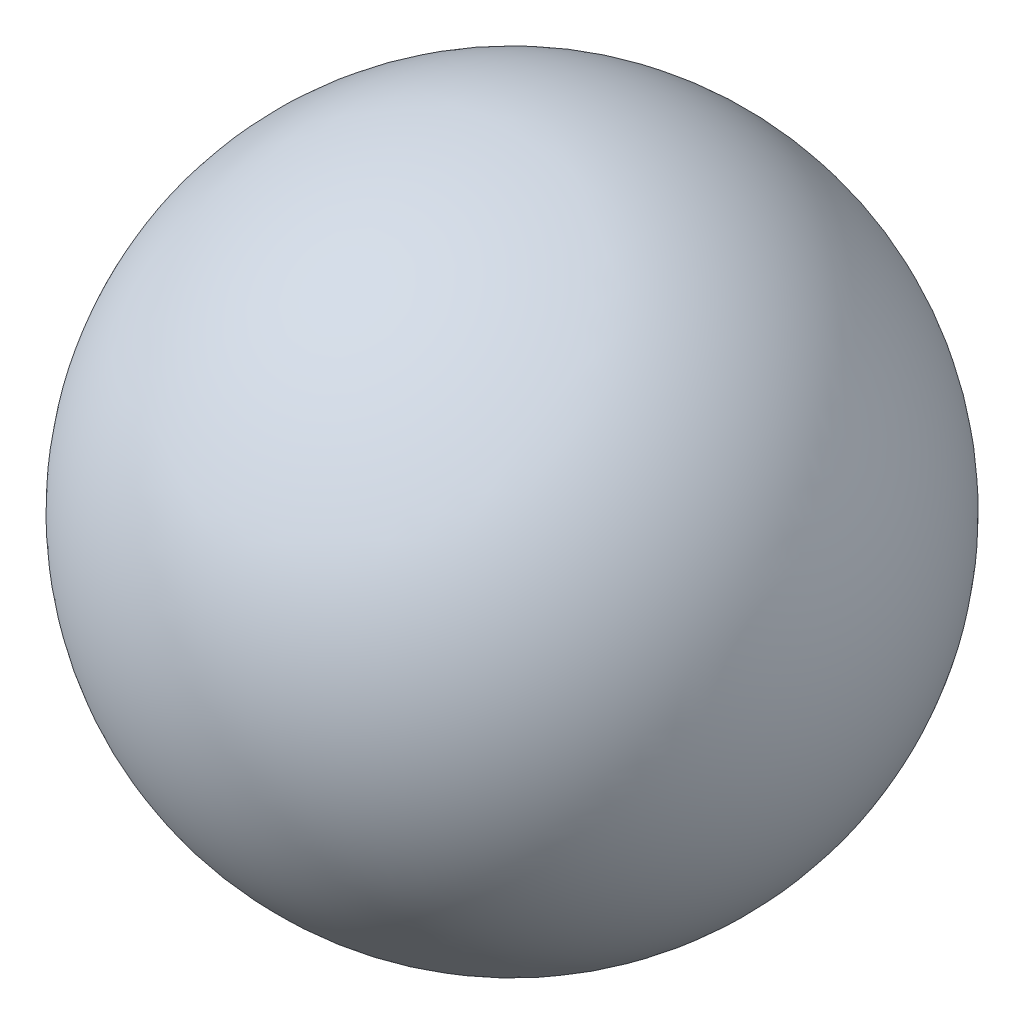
from build123d import *


with BuildPart() as part:
    # Esquisse1 → R_volution1 (revolve)
    with BuildSketch(Plane.XY):
        with BuildLine():
            Line((1.3, 10.5), (6.7, 10.5))
            ThreePointArc((6.7, 10.5), (4, 7.8), (1.3, 10.5))
        make_face()
    revolve(axis=Axis((1.3, 10.5, 0), (1, 0, 0)))


solid = part.part
